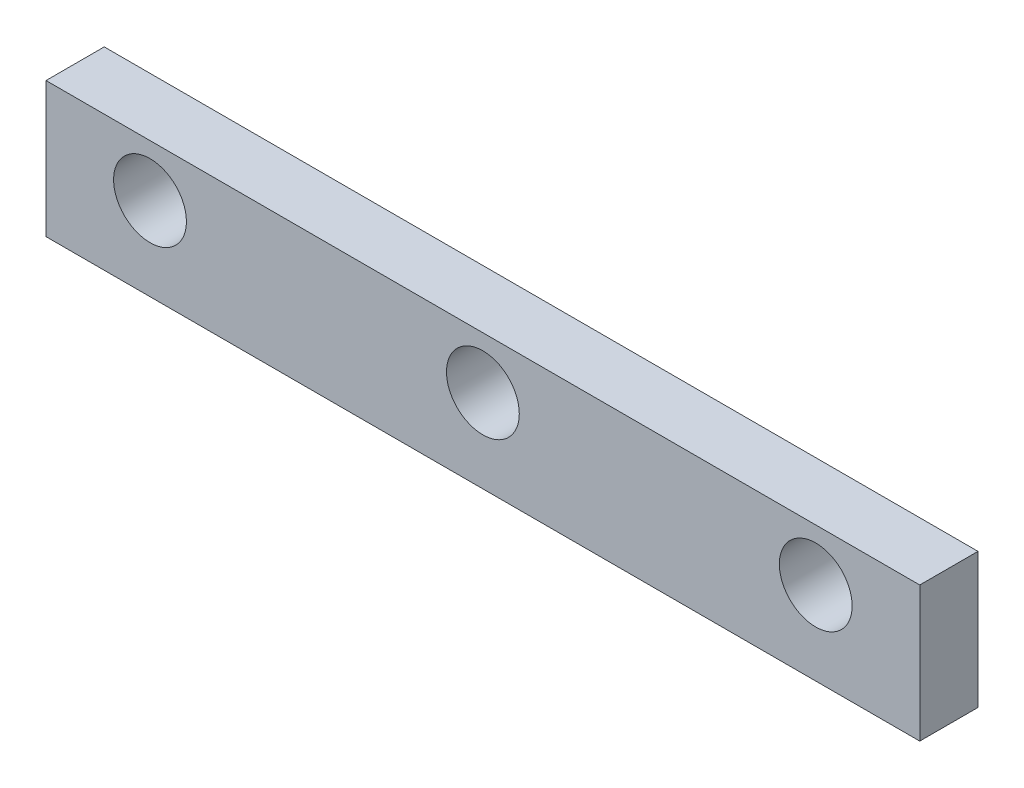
ISO-10303-21;
HEADER;
FILE_DESCRIPTION(('STEP AP214'),'2;1');
FILE_NAME('part.step','',(''),(''),'','','');
FILE_SCHEMA(('AUTOMOTIVE_DESIGN { 1 0 10303 214 1 1 1 1 }'));
ENDSEC;
DATA;
#1=APPLICATION_CONTEXT('core data for automotive mechanical design processes');
#2=APPLICATION_PROTOCOL_DEFINITION('international standard','automotive_design',2000,#1);
#3=PRODUCT_CONTEXT('',#1,'mechanical');
#4=PRODUCT('Part','Part','',(#3));
#5=PRODUCT_RELATED_PRODUCT_CATEGORY('part','',(#4));
#6=PRODUCT_DEFINITION_FORMATION('','',#4);
#7=PRODUCT_DEFINITION_CONTEXT('part definition',#1,'design');
#8=PRODUCT_DEFINITION('design','',#6,#7);
#9=PRODUCT_DEFINITION_SHAPE('','',#8);
#10=(LENGTH_UNIT() NAMED_UNIT(*) SI_UNIT(.MILLI.,.METRE.));
#11=(NAMED_UNIT(*) PLANE_ANGLE_UNIT() SI_UNIT($,.RADIAN.));
#12=(NAMED_UNIT(*) SI_UNIT($,.STERADIAN.) SOLID_ANGLE_UNIT());
#13=UNCERTAINTY_MEASURE_WITH_UNIT(LENGTH_MEASURE(1.E-05),#10,'distance_accuracy_value','');
#14=(GEOMETRIC_REPRESENTATION_CONTEXT(3) GLOBAL_UNCERTAINTY_ASSIGNED_CONTEXT((#13)) GLOBAL_UNIT_ASSIGNED_CONTEXT((#10,
#11,#12)) REPRESENTATION_CONTEXT('',''));
#15=CARTESIAN_POINT('',(0.,0.,0.));
#16=DIRECTION('',(0.,0.,1.));
#17=DIRECTION('',(1.,0.,0.));
#18=AXIS2_PLACEMENT_3D('',#15,#16,#17);
#19=CARTESIAN_POINT('',(0.,0.,2.8));
#20=DIRECTION('',(0.,0.,-1.));
#21=DIRECTION('',(-1.,0.,0.));
#22=AXIS2_PLACEMENT_3D('',#19,#20,#21);
#23=PLANE('',#22);
#24=DIRECTION('',(0.,-1.,0.));
#25=VECTOR('',#24,1.);
#26=CARTESIAN_POINT('',(-21.,0.,2.8));
#27=LINE('',#26,#25);
#28=CARTESIAN_POINT('',(-21.,6.5,2.8));
#29=VERTEX_POINT('',#28);
#30=CARTESIAN_POINT('',(-21.,0.,2.8));
#31=VERTEX_POINT('',#30);
#32=EDGE_CURVE('E85',#29,#31,#27,.T.);
#33=ORIENTED_EDGE('',*,*,#32,.T.);
#34=DIRECTION('',(1.,0.,0.));
#35=VECTOR('',#34,1.);
#36=CARTESIAN_POINT('',(-21.,0.,2.8));
#37=LINE('',#36,#35);
#38=CARTESIAN_POINT('',(21.,0.,2.8));
#39=VERTEX_POINT('',#38);
#40=EDGE_CURVE('E80',#31,#39,#37,.T.);
#41=ORIENTED_EDGE('',*,*,#40,.T.);
#42=DIRECTION('',(0.,1.,0.));
#43=VECTOR('',#42,1.);
#44=CARTESIAN_POINT('',(21.,0.,2.8));
#45=LINE('',#44,#43);
#46=CARTESIAN_POINT('',(21.,6.50000000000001,2.8));
#47=VERTEX_POINT('',#46);
#48=EDGE_CURVE('E83',#39,#47,#45,.T.);
#49=ORIENTED_EDGE('',*,*,#48,.T.);
#50=DIRECTION('',(-1.,0.,0.));
#51=VECTOR('',#50,1.);
#52=CARTESIAN_POINT('',(-21.,6.5,2.8));
#53=LINE('',#52,#51);
#54=EDGE_CURVE('E50',#47,#29,#53,.T.);
#55=ORIENTED_EDGE('',*,*,#54,.T.);
#56=EDGE_LOOP('',(#33,#41,#49,#55));
#57=FACE_BOUND('',#56,.T.);
#58=CARTESIAN_POINT('',(-16.,4.,2.8));
#59=DIRECTION('',(0.,0.,1.));
#60=DIRECTION('',(1.,0.,0.));
#61=AXIS2_PLACEMENT_3D('',#58,#59,#60);
#62=CIRCLE('',#61,1.75);
#63=CARTESIAN_POINT('',(-14.25,4.,2.8));
#64=VERTEX_POINT('',#63);
#65=EDGE_CURVE('E100',#64,#64,#62,.T.);
#66=ORIENTED_EDGE('',*,*,#65,.F.);
#67=EDGE_LOOP('',(#66));
#68=FACE_BOUND('',#67,.T.);
#69=CARTESIAN_POINT('',(16.,4.,2.8));
#70=DIRECTION('',(0.,0.,1.));
#71=DIRECTION('',(-1.,0.,0.));
#72=AXIS2_PLACEMENT_3D('',#69,#70,#71);
#73=CIRCLE('',#72,1.75);
#74=CARTESIAN_POINT('',(14.25,4.,2.8));
#75=VERTEX_POINT('',#74);
#76=EDGE_CURVE('E115',#75,#75,#73,.T.);
#77=ORIENTED_EDGE('',*,*,#76,.F.);
#78=EDGE_LOOP('',(#77));
#79=FACE_BOUND('',#78,.T.);
#80=CARTESIAN_POINT('',(0.,4.,2.8));
#81=DIRECTION('',(0.,0.,1.));
#82=DIRECTION('',(1.,0.,0.));
#83=AXIS2_PLACEMENT_3D('',#80,#81,#82);
#84=CIRCLE('',#83,1.75);
#85=CARTESIAN_POINT('',(1.75,4.,2.8));
#86=VERTEX_POINT('',#85);
#87=EDGE_CURVE('E121',#86,#86,#84,.T.);
#88=ORIENTED_EDGE('',*,*,#87,.F.);
#89=EDGE_LOOP('',(#88));
#90=FACE_BOUND('',#89,.T.);
#91=ADVANCED_FACE('F33',(#57,#68,#79,#90),#23,.F.);
#92=CARTESIAN_POINT('',(0.,0.,0.));
#93=DIRECTION('',(0.,0.,-1.));
#94=DIRECTION('',(-1.,0.,0.));
#95=AXIS2_PLACEMENT_3D('',#92,#93,#94);
#96=PLANE('',#95);
#97=CARTESIAN_POINT('',(16.,4.,0.));
#98=DIRECTION('',(0.,0.,1.));
#99=DIRECTION('',(-1.,0.,0.));
#100=AXIS2_PLACEMENT_3D('',#97,#98,#99);
#101=CIRCLE('',#100,1.75);
#102=CARTESIAN_POINT('',(14.25,4.,0.));
#103=VERTEX_POINT('',#102);
#104=EDGE_CURVE('E118',#103,#103,#101,.T.);
#105=ORIENTED_EDGE('',*,*,#104,.T.);
#106=EDGE_LOOP('',(#105));
#107=FACE_BOUND('',#106,.T.);
#108=DIRECTION('',(0.,-1.,0.));
#109=VECTOR('',#108,1.);
#110=CARTESIAN_POINT('',(-21.,0.,0.));
#111=LINE('',#110,#109);
#112=CARTESIAN_POINT('',(-21.,6.5,0.));
#113=VERTEX_POINT('',#112);
#114=CARTESIAN_POINT('',(-21.,0.,0.));
#115=VERTEX_POINT('',#114);
#116=EDGE_CURVE('E97',#113,#115,#111,.T.);
#117=ORIENTED_EDGE('',*,*,#116,.F.);
#118=DIRECTION('',(-1.,0.,0.));
#119=VECTOR('',#118,1.);
#120=CARTESIAN_POINT('',(-21.,6.5,0.));
#121=LINE('',#120,#119);
#122=CARTESIAN_POINT('',(21.,6.50000000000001,0.));
#123=VERTEX_POINT('',#122);
#124=EDGE_CURVE('E73',#123,#113,#121,.T.);
#125=ORIENTED_EDGE('',*,*,#124,.F.);
#126=DIRECTION('',(0.,1.,0.));
#127=VECTOR('',#126,1.);
#128=CARTESIAN_POINT('',(21.,0.,0.));
#129=LINE('',#128,#127);
#130=CARTESIAN_POINT('',(21.,0.,0.));
#131=VERTEX_POINT('',#130);
#132=EDGE_CURVE('E67',#131,#123,#129,.T.);
#133=ORIENTED_EDGE('',*,*,#132,.F.);
#134=DIRECTION('',(1.,0.,0.));
#135=VECTOR('',#134,1.);
#136=CARTESIAN_POINT('',(-21.,0.,0.));
#137=LINE('',#136,#135);
#138=EDGE_CURVE('E89',#115,#131,#137,.T.);
#139=ORIENTED_EDGE('',*,*,#138,.F.);
#140=EDGE_LOOP('',(#117,#125,#133,#139));
#141=FACE_BOUND('',#140,.T.);
#142=CARTESIAN_POINT('',(-16.,4.,0.));
#143=DIRECTION('',(0.,0.,1.));
#144=DIRECTION('',(1.,0.,0.));
#145=AXIS2_PLACEMENT_3D('',#142,#143,#144);
#146=CIRCLE('',#145,1.75);
#147=CARTESIAN_POINT('',(-14.25,4.,0.));
#148=VERTEX_POINT('',#147);
#149=EDGE_CURVE('E112',#148,#148,#146,.T.);
#150=ORIENTED_EDGE('',*,*,#149,.T.);
#151=EDGE_LOOP('',(#150));
#152=FACE_BOUND('',#151,.T.);
#153=CARTESIAN_POINT('',(0.,4.,0.));
#154=DIRECTION('',(0.,0.,1.));
#155=DIRECTION('',(1.,0.,0.));
#156=AXIS2_PLACEMENT_3D('',#153,#154,#155);
#157=CIRCLE('',#156,1.75);
#158=CARTESIAN_POINT('',(1.75,4.,0.));
#159=VERTEX_POINT('',#158);
#160=EDGE_CURVE('E124',#159,#159,#157,.T.);
#161=ORIENTED_EDGE('',*,*,#160,.T.);
#162=EDGE_LOOP('',(#161));
#163=FACE_BOUND('',#162,.T.);
#164=ADVANCED_FACE('F108',(#107,#141,#152,#163),#96,.T.);
#165=CARTESIAN_POINT('',(-21.,0.,2.8));
#166=DIRECTION('',(1.,0.,0.));
#167=DIRECTION('',(0.,0.,-1.));
#168=AXIS2_PLACEMENT_3D('',#165,#166,#167);
#169=PLANE('',#168);
#170=ORIENTED_EDGE('',*,*,#116,.T.);
#171=DIRECTION('',(0.,0.,-1.));
#172=VECTOR('',#171,1.);
#173=CARTESIAN_POINT('',(-21.,0.,2.8));
#174=LINE('',#173,#172);
#175=EDGE_CURVE('E11',#31,#115,#174,.T.);
#176=ORIENTED_EDGE('',*,*,#175,.F.);
#177=ORIENTED_EDGE('',*,*,#32,.F.);
#178=DIRECTION('',(0.,0.,-1.));
#179=VECTOR('',#178,1.);
#180=CARTESIAN_POINT('',(-21.,6.5,2.8));
#181=LINE('',#180,#179);
#182=EDGE_CURVE('E93',#29,#113,#181,.T.);
#183=ORIENTED_EDGE('',*,*,#182,.T.);
#184=EDGE_LOOP('',(#170,#176,#177,#183));
#185=FACE_BOUND('',#184,.T.);
#186=ADVANCED_FACE('F35',(#185),#169,.F.);
#187=CARTESIAN_POINT('',(-21.,0.,2.8));
#188=DIRECTION('',(0.,1.,0.));
#189=DIRECTION('',(-1.,0.,0.));
#190=AXIS2_PLACEMENT_3D('',#187,#188,#189);
#191=PLANE('',#190);
#192=ORIENTED_EDGE('',*,*,#138,.T.);
#193=DIRECTION('',(0.,0.,-1.));
#194=VECTOR('',#193,1.);
#195=CARTESIAN_POINT('',(21.,0.,2.8));
#196=LINE('',#195,#194);
#197=EDGE_CURVE('E42',#39,#131,#196,.T.);
#198=ORIENTED_EDGE('',*,*,#197,.F.);
#199=ORIENTED_EDGE('',*,*,#40,.F.);
#200=ORIENTED_EDGE('',*,*,#175,.T.);
#201=EDGE_LOOP('',(#192,#198,#199,#200));
#202=FACE_BOUND('',#201,.T.);
#203=ADVANCED_FACE('F88',(#202),#191,.F.);
#204=CARTESIAN_POINT('',(21.,0.,2.8));
#205=DIRECTION('',(-1.,0.,0.));
#206=DIRECTION('',(0.,0.,1.));
#207=AXIS2_PLACEMENT_3D('',#204,#205,#206);
#208=PLANE('',#207);
#209=ORIENTED_EDGE('',*,*,#132,.T.);
#210=DIRECTION('',(0.,0.,-1.));
#211=VECTOR('',#210,1.);
#212=CARTESIAN_POINT('',(21.,6.50000000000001,2.8));
#213=LINE('',#212,#211);
#214=EDGE_CURVE('E90',#47,#123,#213,.T.);
#215=ORIENTED_EDGE('',*,*,#214,.F.);
#216=ORIENTED_EDGE('',*,*,#48,.F.);
#217=ORIENTED_EDGE('',*,*,#197,.T.);
#218=EDGE_LOOP('',(#209,#215,#216,#217));
#219=FACE_BOUND('',#218,.T.);
#220=ADVANCED_FACE('F91',(#219),#208,.F.);
#221=CARTESIAN_POINT('',(-21.,6.5,2.8));
#222=DIRECTION('',(0.,-1.,0.));
#223=DIRECTION('',(1.,0.,0.));
#224=AXIS2_PLACEMENT_3D('',#221,#222,#223);
#225=PLANE('',#224);
#226=ORIENTED_EDGE('',*,*,#124,.T.);
#227=ORIENTED_EDGE('',*,*,#182,.F.);
#228=ORIENTED_EDGE('',*,*,#54,.F.);
#229=ORIENTED_EDGE('',*,*,#214,.T.);
#230=EDGE_LOOP('',(#226,#227,#228,#229));
#231=FACE_BOUND('',#230,.T.);
#232=ADVANCED_FACE('F105',(#231),#225,.F.);
#233=CARTESIAN_POINT('',(-16.,4.,2.8));
#234=DIRECTION('',(0.,0.,-1.));
#235=DIRECTION('',(-1.,0.,0.));
#236=AXIS2_PLACEMENT_3D('',#233,#234,#235);
#237=CYLINDRICAL_SURFACE('',#236,1.75);
#238=ORIENTED_EDGE('',*,*,#65,.T.);
#239=EDGE_LOOP('',(#238));
#240=FACE_BOUND('',#239,.T.);
#241=ORIENTED_EDGE('',*,*,#149,.F.);
#242=EDGE_LOOP('',(#241));
#243=FACE_BOUND('',#242,.T.);
#244=ADVANCED_FACE('F141',(#240,#243),#237,.F.);
#245=CARTESIAN_POINT('',(16.,4.,2.8));
#246=DIRECTION('',(0.,0.,-1.));
#247=DIRECTION('',(-1.,0.,0.));
#248=AXIS2_PLACEMENT_3D('',#245,#246,#247);
#249=CYLINDRICAL_SURFACE('',#248,1.75);
#250=ORIENTED_EDGE('',*,*,#76,.T.);
#251=EDGE_LOOP('',(#250));
#252=FACE_BOUND('',#251,.T.);
#253=ORIENTED_EDGE('',*,*,#104,.F.);
#254=EDGE_LOOP('',(#253));
#255=FACE_BOUND('',#254,.T.);
#256=ADVANCED_FACE('F187',(#252,#255),#249,.F.);
#257=CARTESIAN_POINT('',(0.,4.,2.8));
#258=DIRECTION('',(0.,0.,-1.));
#259=DIRECTION('',(-1.,0.,0.));
#260=AXIS2_PLACEMENT_3D('',#257,#258,#259);
#261=CYLINDRICAL_SURFACE('',#260,1.75);
#262=ORIENTED_EDGE('',*,*,#87,.T.);
#263=EDGE_LOOP('',(#262));
#264=FACE_BOUND('',#263,.T.);
#265=ORIENTED_EDGE('',*,*,#160,.F.);
#266=EDGE_LOOP('',(#265));
#267=FACE_BOUND('',#266,.T.);
#268=ADVANCED_FACE('F130',(#264,#267),#261,.F.);
#269=CLOSED_SHELL('',(#91,#164,#186,#203,#220,#232,#244,#256,#268));
#270=MANIFOLD_SOLID_BREP('B2',#269);
#271=ADVANCED_BREP_SHAPE_REPRESENTATION('',(#18,#270),#14);
#272=SHAPE_DEFINITION_REPRESENTATION(#9,#271);
ENDSEC;
END-ISO-10303-21;
